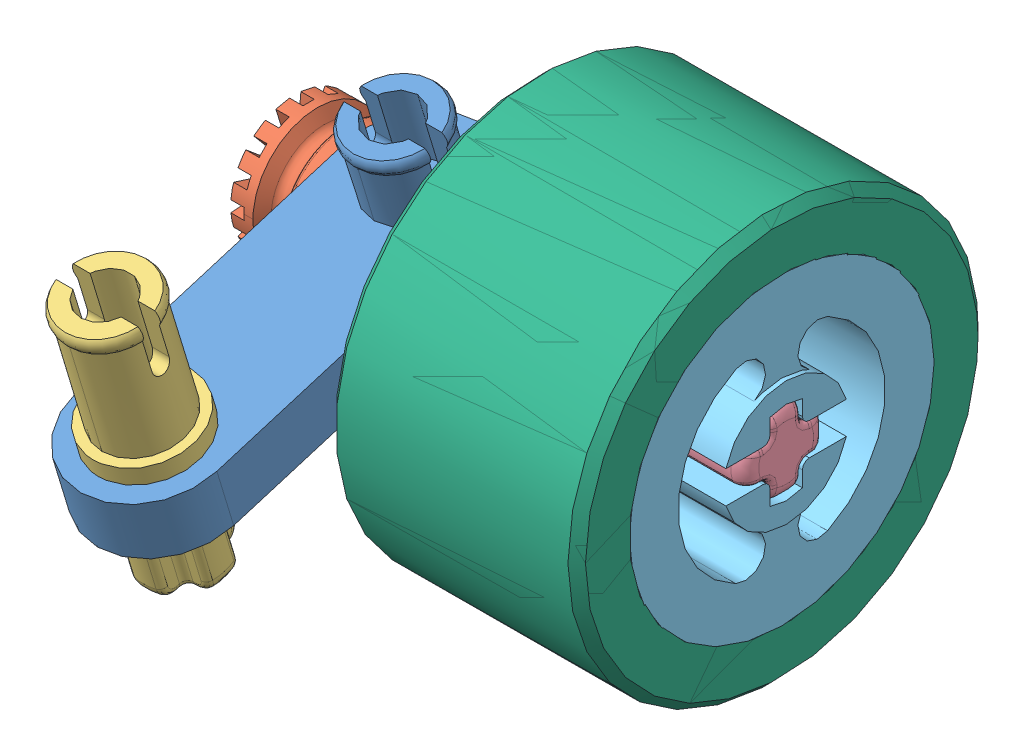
SolidWorks assembly right wheel mount.SLDASM, configuration Default (file format 4400). Lengths in mm.
Overall size (28.09 26.66 33.23).
8 component instances, 6 part files, 10 mates.
Components (placement in the parent):
- knuckle-2: knuckle.SLDPRT [Default] at (-27.5208 -0.0867 8.2685) x (0 0.290339 -0.956924) z (1 0 0) size (23.81 17.65 7.94)
- small collar-1: small collar.SLDPRT [Default] at (-35.4265 0 0) x (0 0 -1) z (0 -1 0) size (7.37 3.94 7.37)
- axle pin-1: axle pin.SLDPRT [Default] at (-27.5208 -0.8113 16.3434) x (0 -0.956924 -0.290339) z (0 -0.290339 0.956924) size (16.18 5.84 5.84)
- 4 axle-2: 4 axle.SLDPRT [Default] at (-21.4284 0 0) size (28.09 4.72 4.72)
- Assem1brede wielen-1: Assem1brede wielen.SLDASM [Default] at (-11.1603 -2.3422 -0.3273) size (14.73 23.39 23.39)
  - wheelDubbel reed-1: wheelDubbel reed.sldprt [Default] at (-3.6359 2.3422 0.3273) size (14.73 17.39 17.39)
  - tireSlik-3: tireSlik.sldprt [Default] at (65.1518 2.3422 0.3273) size (14.22 23.39 23.39)
  - tireSlik-4: tireSlik.sldprt [Default] at (65.1518 2.3422 0.3273) size (14.22 23.39 23.39)
Mates (geometry in assembly coordinates):
- Concentric6: concentric aligned: cylinder of knuckle-2 through (-27.5208 -3.9711 15.3847) axis (0 0.956924 0.290339) radius 2.3876; cylinder of axle pin-1 through (-27.5208 -8.3462 14.0573) axis (0 0.956924 0.290339) radius 2.3622
- Parallel4: parallel anti-aligned: plane of knuckle-2 through (-28.4415 -4.2384 16.2658) normal (1 0 0); plane of axle pin-1 through (-28.4415 -1.0787 17.2245) normal (-1 0 0)
- Coincident9: coincident anti-aligned: plane of knuckle-2 through (-27.5208 3.7978 1.1523) normal (0 0.956924 0.290339); plane of axle pin-1 through (-27.5208 -0.8113 16.3434) normal (0 -0.956924 -0.290339)
- Coincident10: coincident anti-aligned: plane of knuckle-2 through (-31.4895 -0.8113 16.3434) normal (-1 0 0); plane of small collar-1 through (-31.4895 0 0) normal (1 0 0)
- Concentric7: concentric aligned: circle of knuckle-2; circle of 4 axle-2
- Concentric8: concentric anti-aligned: circle of knuckle-2; circle of small collar-1
- Coincident11: coincident aligned: plane of small collar-1 through (-35.4265 0 0) normal (-1 0 0); plane of 4 axle-2 through (-35.4265 0 0) normal (-1 0 0)
- Coincident12: coincident anti-aligned: plane of 4 axle-2 through (-35.473 -0.9208 0.9208) normal (0 -1 0); plane of Assem1brede wielen-1/wheelDubbel reed-1 through (-14.7962 -0.9208 3.4347) normal (0 1 0)
- Coincident13: coincident anti-aligned: plane of 4 axle-2 through (-35.4265 2.1754 -0.9208) normal (0 0 -1); plane of Assem1brede wielen-1/wheelDubbel reed-1 through (-14.7962 0.9208 -0.9208) normal (0 0 1)
- Coincident14: coincident aligned: plane of 4 axle-2 through (-7.4302 0 0) normal (1 0 0); plane of Assem1brede wielen-1/wheelDubbel reed-1 through (-7.4302 0 0) normal (1 0 0)
